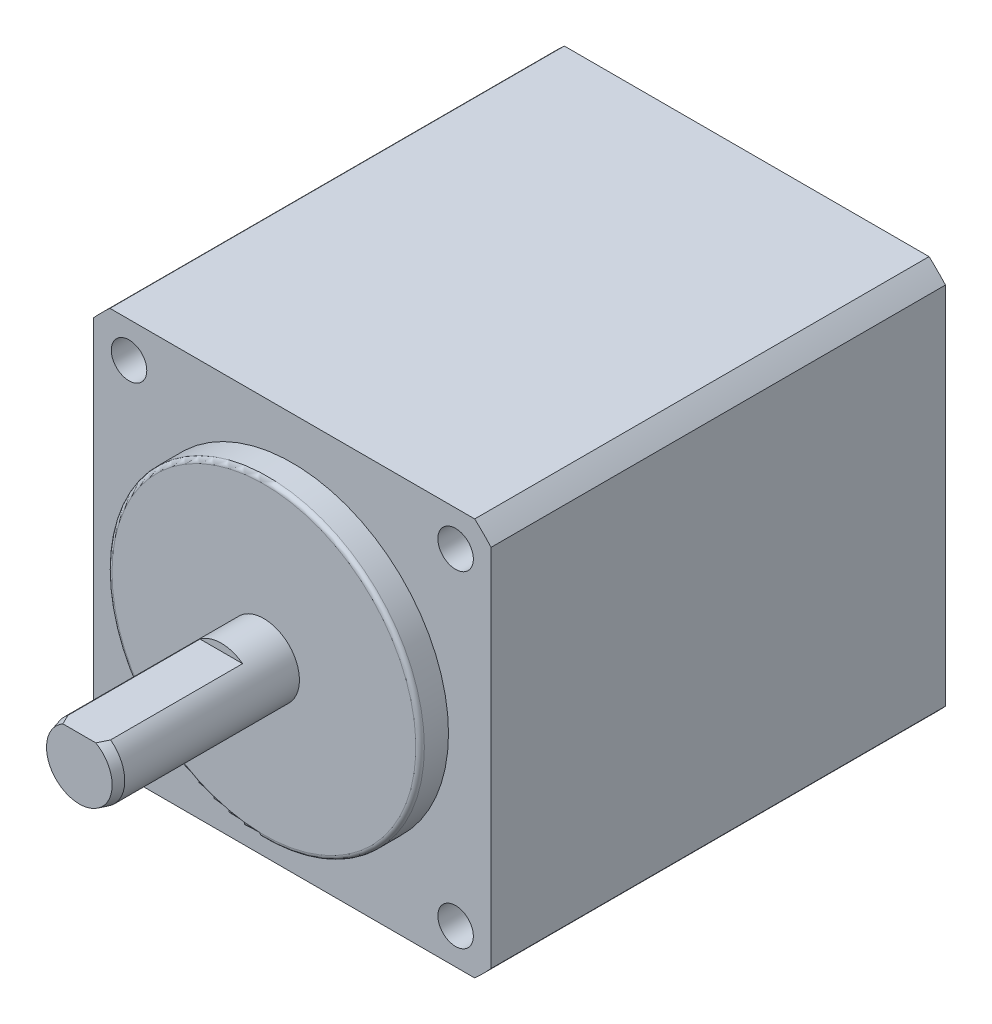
ISO-10303-21;
HEADER;
FILE_DESCRIPTION(('STEP AP214'),'2;1');
FILE_NAME('part.step','',(''),(''),'','','');
FILE_SCHEMA(('AUTOMOTIVE_DESIGN { 1 0 10303 214 1 1 1 1 }'));
ENDSEC;
DATA;
#1=APPLICATION_CONTEXT('core data for automotive mechanical design processes');
#2=APPLICATION_PROTOCOL_DEFINITION('international standard','automotive_design',2000,#1);
#3=PRODUCT_CONTEXT('',#1,'mechanical');
#4=PRODUCT('Part','Part','',(#3));
#5=PRODUCT_RELATED_PRODUCT_CATEGORY('part','',(#4));
#6=PRODUCT_DEFINITION_FORMATION('','',#4);
#7=PRODUCT_DEFINITION_CONTEXT('part definition',#1,'design');
#8=PRODUCT_DEFINITION('design','',#6,#7);
#9=PRODUCT_DEFINITION_SHAPE('','',#8);
#10=(LENGTH_UNIT() NAMED_UNIT(*) SI_UNIT(.MILLI.,.METRE.));
#11=(NAMED_UNIT(*) PLANE_ANGLE_UNIT() SI_UNIT($,.RADIAN.));
#12=(NAMED_UNIT(*) SI_UNIT($,.STERADIAN.) SOLID_ANGLE_UNIT());
#13=UNCERTAINTY_MEASURE_WITH_UNIT(LENGTH_MEASURE(1.E-05),#10,'distance_accuracy_value','');
#14=(GEOMETRIC_REPRESENTATION_CONTEXT(3) GLOBAL_UNCERTAINTY_ASSIGNED_CONTEXT((#13)) GLOBAL_UNIT_ASSIGNED_CONTEXT((#10,
#11,#12)) REPRESENTATION_CONTEXT('',''));
#15=CARTESIAN_POINT('',(0.,0.,0.));
#16=DIRECTION('',(0.,0.,1.));
#17=DIRECTION('',(1.,0.,0.));
#18=AXIS2_PLACEMENT_3D('',#15,#16,#17);
#19=CARTESIAN_POINT('',(-14.,0.,-32.));
#20=DIRECTION('',(1.,0.,0.));
#21=DIRECTION('',(0.,0.,-1.));
#22=AXIS2_PLACEMENT_3D('',#19,#20,#21);
#23=PLANE('',#22);
#24=DIRECTION('',(0.,1.,0.));
#25=VECTOR('',#24,1.);
#26=CARTESIAN_POINT('',(-14.,0.,0.));
#27=LINE('',#26,#25);
#28=CARTESIAN_POINT('',(-14.,-12.8452325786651,0.));
#29=VERTEX_POINT('',#28);
#30=CARTESIAN_POINT('',(-14.,12.8452325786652,0.));
#31=VERTEX_POINT('',#30);
#32=EDGE_CURVE('E315',#29,#31,#27,.T.);
#33=ORIENTED_EDGE('',*,*,#32,.T.);
#34=DIRECTION('',(0.,0.,1.));
#35=VECTOR('',#34,1.);
#36=CARTESIAN_POINT('',(-14.,12.8452325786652,-32.));
#37=LINE('',#36,#35);
#38=CARTESIAN_POINT('',(-14.,12.8452325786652,-32.));
#39=VERTEX_POINT('',#38);
#40=EDGE_CURVE('E219',#39,#31,#37,.T.);
#41=ORIENTED_EDGE('',*,*,#40,.F.);
#42=DIRECTION('',(0.,1.,0.));
#43=VECTOR('',#42,1.);
#44=CARTESIAN_POINT('',(-14.,0.,-32.));
#45=LINE('',#44,#43);
#46=CARTESIAN_POINT('',(-14.,-12.8452325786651,-32.));
#47=VERTEX_POINT('',#46);
#48=EDGE_CURVE('E382',#47,#39,#45,.T.);
#49=ORIENTED_EDGE('',*,*,#48,.F.);
#50=DIRECTION('',(0.,0.,1.));
#51=VECTOR('',#50,1.);
#52=CARTESIAN_POINT('',(-14.,-12.8452325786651,-32.));
#53=LINE('',#52,#51);
#54=EDGE_CURVE('E319',#47,#29,#53,.T.);
#55=ORIENTED_EDGE('',*,*,#54,.T.);
#56=EDGE_LOOP('',(#33,#41,#49,#55));
#57=FACE_BOUND('',#56,.T.);
#58=ADVANCED_FACE('F47',(#57),#23,.F.);
#59=CARTESIAN_POINT('',(0.,0.,-32.));
#60=DIRECTION('',(0.,0.,1.));
#61=DIRECTION('',(1.,0.,0.));
#62=AXIS2_PLACEMENT_3D('',#59,#60,#61);
#63=CYLINDRICAL_SURFACE('',#62,19.);
#64=CARTESIAN_POINT('',(0.,0.,0.));
#65=DIRECTION('',(0.,0.,-1.));
#66=DIRECTION('',(-1.,0.,0.));
#67=AXIS2_PLACEMENT_3D('',#64,#65,#66);
#68=CIRCLE('',#67,19.);
#69=CARTESIAN_POINT('',(-12.8452325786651,14.,0.));
#70=VERTEX_POINT('',#69);
#71=EDGE_CURVE('E322',#31,#70,#68,.T.);
#72=ORIENTED_EDGE('',*,*,#71,.T.);
#73=DIRECTION('',(0.,0.,1.));
#74=VECTOR('',#73,1.);
#75=CARTESIAN_POINT('',(-12.8452325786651,14.,-32.));
#76=LINE('',#75,#74);
#77=CARTESIAN_POINT('',(-12.8452325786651,14.,-32.));
#78=VERTEX_POINT('',#77);
#79=EDGE_CURVE('E356',#78,#70,#76,.T.);
#80=ORIENTED_EDGE('',*,*,#79,.F.);
#81=CARTESIAN_POINT('',(0.,0.,-32.));
#82=DIRECTION('',(0.,0.,-1.));
#83=DIRECTION('',(-1.,0.,0.));
#84=AXIS2_PLACEMENT_3D('',#81,#82,#83);
#85=CIRCLE('',#84,19.);
#86=EDGE_CURVE('E385',#39,#78,#85,.T.);
#87=ORIENTED_EDGE('',*,*,#86,.F.);
#88=ORIENTED_EDGE('',*,*,#40,.T.);
#89=EDGE_LOOP('',(#72,#80,#87,#88));
#90=FACE_BOUND('',#89,.T.);
#91=ADVANCED_FACE('F292',(#90),#63,.T.);
#92=CARTESIAN_POINT('',(0.,14.,-32.));
#93=DIRECTION('',(0.,-1.,0.));
#94=DIRECTION('',(0.,0.,-1.));
#95=AXIS2_PLACEMENT_3D('',#92,#93,#94);
#96=PLANE('',#95);
#97=DIRECTION('',(1.,0.,0.));
#98=VECTOR('',#97,1.);
#99=CARTESIAN_POINT('',(0.,14.,0.));
#100=LINE('',#99,#98);
#101=CARTESIAN_POINT('',(12.8452325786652,14.,0.));
#102=VERTEX_POINT('',#101);
#103=EDGE_CURVE('E325',#70,#102,#100,.T.);
#104=ORIENTED_EDGE('',*,*,#103,.T.);
#105=DIRECTION('',(0.,0.,1.));
#106=VECTOR('',#105,1.);
#107=CARTESIAN_POINT('',(12.8452325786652,14.,-32.));
#108=LINE('',#107,#106);
#109=CARTESIAN_POINT('',(12.8452325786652,14.,-32.));
#110=VERTEX_POINT('',#109);
#111=EDGE_CURVE('E353',#110,#102,#108,.T.);
#112=ORIENTED_EDGE('',*,*,#111,.F.);
#113=DIRECTION('',(1.,0.,0.));
#114=VECTOR('',#113,1.);
#115=CARTESIAN_POINT('',(0.,14.,-32.));
#116=LINE('',#115,#114);
#117=EDGE_CURVE('E387',#78,#110,#116,.T.);
#118=ORIENTED_EDGE('',*,*,#117,.F.);
#119=ORIENTED_EDGE('',*,*,#79,.T.);
#120=EDGE_LOOP('',(#104,#112,#118,#119));
#121=FACE_BOUND('',#120,.T.);
#122=ADVANCED_FACE('F302',(#121),#96,.F.);
#123=CARTESIAN_POINT('',(14.,12.8452325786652,0.));
#124=VERTEX_POINT('',#123);
#125=EDGE_CURVE('E328',#102,#124,#68,.T.);
#126=ORIENTED_EDGE('',*,*,#125,.T.);
#127=DIRECTION('',(0.,0.,1.));
#128=VECTOR('',#127,1.);
#129=CARTESIAN_POINT('',(14.,12.8452325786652,-32.));
#130=LINE('',#129,#128);
#131=CARTESIAN_POINT('',(14.,12.8452325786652,-32.));
#132=VERTEX_POINT('',#131);
#133=EDGE_CURVE('E351',#132,#124,#130,.T.);
#134=ORIENTED_EDGE('',*,*,#133,.F.);
#135=EDGE_CURVE('E388',#110,#132,#85,.T.);
#136=ORIENTED_EDGE('',*,*,#135,.F.);
#137=ORIENTED_EDGE('',*,*,#111,.T.);
#138=EDGE_LOOP('',(#126,#134,#136,#137));
#139=FACE_BOUND('',#138,.T.);
#140=ADVANCED_FACE('F300',(#139),#63,.T.);
#141=CARTESIAN_POINT('',(14.,0.,-32.));
#142=DIRECTION('',(1.,0.,0.));
#143=DIRECTION('',(0.,0.,-1.));
#144=AXIS2_PLACEMENT_3D('',#141,#142,#143);
#145=PLANE('',#144);
#146=DIRECTION('',(0.,1.,0.));
#147=VECTOR('',#146,1.);
#148=CARTESIAN_POINT('',(14.,0.,0.));
#149=LINE('',#148,#147);
#150=CARTESIAN_POINT('',(14.,-12.8452325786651,0.));
#151=VERTEX_POINT('',#150);
#152=EDGE_CURVE('E336',#151,#124,#149,.T.);
#153=ORIENTED_EDGE('',*,*,#152,.F.);
#154=DIRECTION('',(0.,0.,1.));
#155=VECTOR('',#154,1.);
#156=CARTESIAN_POINT('',(14.,-12.8452325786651,-32.));
#157=LINE('',#156,#155);
#158=CARTESIAN_POINT('',(14.,-12.8452325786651,-32.));
#159=VERTEX_POINT('',#158);
#160=EDGE_CURVE('E349',#159,#151,#157,.T.);
#161=ORIENTED_EDGE('',*,*,#160,.F.);
#162=DIRECTION('',(0.,1.,0.));
#163=VECTOR('',#162,1.);
#164=CARTESIAN_POINT('',(14.,0.,-32.));
#165=LINE('',#164,#163);
#166=EDGE_CURVE('E389',#159,#132,#165,.T.);
#167=ORIENTED_EDGE('',*,*,#166,.T.);
#168=ORIENTED_EDGE('',*,*,#133,.T.);
#169=EDGE_LOOP('',(#153,#161,#167,#168));
#170=FACE_BOUND('',#169,.T.);
#171=ADVANCED_FACE('F297',(#170),#145,.T.);
#172=CARTESIAN_POINT('',(12.8452325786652,-14.,0.));
#173=VERTEX_POINT('',#172);
#174=EDGE_CURVE('E339',#151,#173,#68,.T.);
#175=ORIENTED_EDGE('',*,*,#174,.T.);
#176=DIRECTION('',(0.,0.,1.));
#177=VECTOR('',#176,1.);
#178=CARTESIAN_POINT('',(12.8452325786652,-14.,-32.));
#179=LINE('',#178,#177);
#180=CARTESIAN_POINT('',(12.8452325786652,-14.,-32.));
#181=VERTEX_POINT('',#180);
#182=EDGE_CURVE('E347',#181,#173,#179,.T.);
#183=ORIENTED_EDGE('',*,*,#182,.F.);
#184=EDGE_CURVE('E364',#159,#181,#85,.T.);
#185=ORIENTED_EDGE('',*,*,#184,.F.);
#186=ORIENTED_EDGE('',*,*,#160,.T.);
#187=EDGE_LOOP('',(#175,#183,#185,#186));
#188=FACE_BOUND('',#187,.T.);
#189=ADVANCED_FACE('F293',(#188),#63,.T.);
#190=CARTESIAN_POINT('',(0.,-14.,-32.));
#191=DIRECTION('',(0.,-1.,0.));
#192=DIRECTION('',(0.,0.,-1.));
#193=AXIS2_PLACEMENT_3D('',#190,#191,#192);
#194=PLANE('',#193);
#195=DIRECTION('',(0.,0.,-1.));
#196=VECTOR('',#195,1.);
#197=CARTESIAN_POINT('',(-7.6,-14.,-32.));
#198=LINE('',#197,#196);
#199=CARTESIAN_POINT('',(-7.6,-14.,-22.5));
#200=VERTEX_POINT('',#199);
#201=CARTESIAN_POINT('',(-7.6,-14.,-32.));
#202=VERTEX_POINT('',#201);
#203=EDGE_CURVE('E191',#200,#202,#198,.T.);
#204=ORIENTED_EDGE('',*,*,#203,.F.);
#205=DIRECTION('',(-1.,0.,0.));
#206=VECTOR('',#205,1.);
#207=CARTESIAN_POINT('',(-7.6,-14.,-22.5));
#208=LINE('',#207,#206);
#209=CARTESIAN_POINT('',(7.6,-14.,-22.5));
#210=VERTEX_POINT('',#209);
#211=EDGE_CURVE('E198',#210,#200,#208,.T.);
#212=ORIENTED_EDGE('',*,*,#211,.F.);
#213=DIRECTION('',(0.,0.,1.));
#214=VECTOR('',#213,1.);
#215=CARTESIAN_POINT('',(7.6,-14.,-32.));
#216=LINE('',#215,#214);
#217=CARTESIAN_POINT('',(7.6,-14.,-32.));
#218=VERTEX_POINT('',#217);
#219=EDGE_CURVE('E212',#218,#210,#216,.T.);
#220=ORIENTED_EDGE('',*,*,#219,.F.);
#221=DIRECTION('',(1.,0.,0.));
#222=VECTOR('',#221,1.);
#223=CARTESIAN_POINT('',(0.,-14.,-32.));
#224=LINE('',#223,#222);
#225=EDGE_CURVE('E362',#218,#181,#224,.T.);
#226=ORIENTED_EDGE('',*,*,#225,.T.);
#227=ORIENTED_EDGE('',*,*,#182,.T.);
#228=DIRECTION('',(1.,0.,0.));
#229=VECTOR('',#228,1.);
#230=CARTESIAN_POINT('',(0.,-14.,0.));
#231=LINE('',#230,#229);
#232=CARTESIAN_POINT('',(-12.8452325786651,-14.,0.));
#233=VERTEX_POINT('',#232);
#234=EDGE_CURVE('E340',#233,#173,#231,.T.);
#235=ORIENTED_EDGE('',*,*,#234,.F.);
#236=DIRECTION('',(0.,0.,1.));
#237=VECTOR('',#236,1.);
#238=CARTESIAN_POINT('',(-12.8452325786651,-14.,-32.));
#239=LINE('',#238,#237);
#240=CARTESIAN_POINT('',(-12.8452325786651,-14.,-32.));
#241=VERTEX_POINT('',#240);
#242=EDGE_CURVE('E344',#241,#233,#239,.T.);
#243=ORIENTED_EDGE('',*,*,#242,.F.);
#244=EDGE_CURVE('E360',#241,#202,#224,.T.);
#245=ORIENTED_EDGE('',*,*,#244,.T.);
#246=EDGE_LOOP('',(#204,#212,#220,#226,#227,#235,#243,#245));
#247=FACE_BOUND('',#246,.T.);
#248=ADVANCED_FACE('F290',(#247),#194,.T.);
#249=EDGE_CURVE('E327',#233,#29,#68,.T.);
#250=ORIENTED_EDGE('',*,*,#249,.T.);
#251=ORIENTED_EDGE('',*,*,#54,.F.);
#252=EDGE_CURVE('E345',#241,#47,#85,.T.);
#253=ORIENTED_EDGE('',*,*,#252,.F.);
#254=ORIENTED_EDGE('',*,*,#242,.T.);
#255=EDGE_LOOP('',(#250,#251,#253,#254));
#256=FACE_BOUND('',#255,.T.);
#257=ADVANCED_FACE('F284',(#256),#63,.T.);
#258=CARTESIAN_POINT('',(0.,0.,-32.));
#259=DIRECTION('',(0.,0.,-1.));
#260=DIRECTION('',(-1.,0.,0.));
#261=AXIS2_PLACEMENT_3D('',#258,#259,#260);
#262=PLANE('',#261);
#263=DIRECTION('',(-1.,0.,0.));
#264=VECTOR('',#263,1.);
#265=CARTESIAN_POINT('',(0.,2.,-32.));
#266=LINE('',#265,#264);
#267=CARTESIAN_POINT('',(1.5,2.,-32.));
#268=VERTEX_POINT('',#267);
#269=CARTESIAN_POINT('',(-1.5,2.,-32.));
#270=VERTEX_POINT('',#269);
#271=EDGE_CURVE('E154',#268,#270,#266,.T.);
#272=ORIENTED_EDGE('',*,*,#271,.T.);
#273=CARTESIAN_POINT('',(0.,0.,-32.));
#274=DIRECTION('',(0.,0.,-1.));
#275=DIRECTION('',(-1.,0.,0.));
#276=AXIS2_PLACEMENT_3D('',#273,#274,#275);
#277=CIRCLE('',#276,2.5);
#278=EDGE_CURVE('E159',#268,#270,#277,.T.);
#279=ORIENTED_EDGE('',*,*,#278,.F.);
#280=EDGE_LOOP('',(#272,#279));
#281=FACE_BOUND('',#280,.T.);
#282=ORIENTED_EDGE('',*,*,#48,.T.);
#283=ORIENTED_EDGE('',*,*,#86,.T.);
#284=ORIENTED_EDGE('',*,*,#117,.T.);
#285=ORIENTED_EDGE('',*,*,#135,.T.);
#286=ORIENTED_EDGE('',*,*,#166,.F.);
#287=ORIENTED_EDGE('',*,*,#184,.T.);
#288=ORIENTED_EDGE('',*,*,#225,.F.);
#289=DIRECTION('',(0.,1.,0.));
#290=VECTOR('',#289,1.);
#291=CARTESIAN_POINT('',(7.6,-19.,-32.));
#292=LINE('',#291,#290);
#293=CARTESIAN_POINT('',(7.6,-19.,-32.));
#294=VERTEX_POINT('',#293);
#295=EDGE_CURVE('E330',#294,#218,#292,.T.);
#296=ORIENTED_EDGE('',*,*,#295,.F.);
#297=DIRECTION('',(1.,0.,0.));
#298=VECTOR('',#297,1.);
#299=CARTESIAN_POINT('',(-7.6,-19.,-32.));
#300=LINE('',#299,#298);
#301=CARTESIAN_POINT('',(-7.6,-19.,-32.));
#302=VERTEX_POINT('',#301);
#303=EDGE_CURVE('E197',#302,#294,#300,.T.);
#304=ORIENTED_EDGE('',*,*,#303,.F.);
#305=DIRECTION('',(0.,1.,0.));
#306=VECTOR('',#305,1.);
#307=CARTESIAN_POINT('',(-7.6,-19.,-32.));
#308=LINE('',#307,#306);
#309=EDGE_CURVE('E323',#302,#202,#308,.T.);
#310=ORIENTED_EDGE('',*,*,#309,.T.);
#311=ORIENTED_EDGE('',*,*,#244,.F.);
#312=ORIENTED_EDGE('',*,*,#252,.T.);
#313=EDGE_LOOP('',(#282,#283,#284,#285,#286,#287,#288,#296,#304,#310,#311,#312));
#314=FACE_BOUND('',#313,.T.);
#315=ADVANCED_FACE('F163',(#281,#314),#262,.T.);
#316=CARTESIAN_POINT('',(0.,0.,0.));
#317=DIRECTION('',(0.,0.,-1.));
#318=DIRECTION('',(-1.,0.,0.));
#319=AXIS2_PLACEMENT_3D('',#316,#317,#318);
#320=PLANE('',#319);
#321=CARTESIAN_POINT('',(11.5,-11.5,0.));
#322=DIRECTION('',(0.,0.,1.));
#323=DIRECTION('',(1.,0.,0.));
#324=AXIS2_PLACEMENT_3D('',#321,#322,#323);
#325=CIRCLE('',#324,1.25);
#326=CARTESIAN_POINT('',(12.75,-11.5,0.));
#327=VERTEX_POINT('',#326);
#328=EDGE_CURVE('E169',#327,#327,#325,.T.);
#329=ORIENTED_EDGE('',*,*,#328,.F.);
#330=EDGE_LOOP('',(#329));
#331=FACE_BOUND('',#330,.T.);
#332=CARTESIAN_POINT('',(-11.5,-11.5,0.));
#333=DIRECTION('',(0.,0.,1.));
#334=DIRECTION('',(1.,0.,0.));
#335=AXIS2_PLACEMENT_3D('',#332,#333,#334);
#336=CIRCLE('',#335,1.25);
#337=CARTESIAN_POINT('',(-10.25,-11.5,0.));
#338=VERTEX_POINT('',#337);
#339=EDGE_CURVE('E173',#338,#338,#336,.T.);
#340=ORIENTED_EDGE('',*,*,#339,.F.);
#341=EDGE_LOOP('',(#340));
#342=FACE_BOUND('',#341,.T.);
#343=CARTESIAN_POINT('',(11.5,11.5,0.));
#344=DIRECTION('',(0.,0.,1.));
#345=DIRECTION('',(1.,0.,0.));
#346=AXIS2_PLACEMENT_3D('',#343,#344,#345);
#347=CIRCLE('',#346,1.25);
#348=CARTESIAN_POINT('',(12.75,11.5,0.));
#349=VERTEX_POINT('',#348);
#350=EDGE_CURVE('E179',#349,#349,#347,.T.);
#351=ORIENTED_EDGE('',*,*,#350,.F.);
#352=EDGE_LOOP('',(#351));
#353=FACE_BOUND('',#352,.T.);
#354=CARTESIAN_POINT('',(-11.5,11.5,0.));
#355=DIRECTION('',(0.,0.,1.));
#356=DIRECTION('',(1.,0.,0.));
#357=AXIS2_PLACEMENT_3D('',#354,#355,#356);
#358=CIRCLE('',#357,1.25);
#359=CARTESIAN_POINT('',(-10.25,11.5,0.));
#360=VERTEX_POINT('',#359);
#361=EDGE_CURVE('E185',#360,#360,#358,.T.);
#362=ORIENTED_EDGE('',*,*,#361,.F.);
#363=EDGE_LOOP('',(#362));
#364=FACE_BOUND('',#363,.T.);
#365=ORIENTED_EDGE('',*,*,#32,.F.);
#366=ORIENTED_EDGE('',*,*,#249,.F.);
#367=ORIENTED_EDGE('',*,*,#234,.T.);
#368=ORIENTED_EDGE('',*,*,#174,.F.);
#369=ORIENTED_EDGE('',*,*,#152,.T.);
#370=ORIENTED_EDGE('',*,*,#125,.F.);
#371=ORIENTED_EDGE('',*,*,#103,.F.);
#372=ORIENTED_EDGE('',*,*,#71,.F.);
#373=EDGE_LOOP('',(#365,#366,#367,#368,#369,#370,#371,#372));
#374=FACE_BOUND('',#373,.T.);
#375=ADVANCED_FACE('F280',(#331,#342,#353,#364,#374),#320,.F.);
#376=CARTESIAN_POINT('',(-7.6,-19.,-32.));
#377=DIRECTION('',(1.,0.,0.));
#378=DIRECTION('',(0.,0.,-1.));
#379=AXIS2_PLACEMENT_3D('',#376,#377,#378);
#380=PLANE('',#379);
#381=ORIENTED_EDGE('',*,*,#203,.T.);
#382=ORIENTED_EDGE('',*,*,#309,.F.);
#383=DIRECTION('',(0.,0.,-1.));
#384=VECTOR('',#383,1.);
#385=CARTESIAN_POINT('',(-7.6,-19.,-32.));
#386=LINE('',#385,#384);
#387=CARTESIAN_POINT('',(-7.6,-19.,-22.5));
#388=VERTEX_POINT('',#387);
#389=EDGE_CURVE('E194',#388,#302,#386,.T.);
#390=ORIENTED_EDGE('',*,*,#389,.F.);
#391=DIRECTION('',(0.,1.,0.));
#392=VECTOR('',#391,1.);
#393=CARTESIAN_POINT('',(-7.6,-19.,-22.5));
#394=LINE('',#393,#392);
#395=EDGE_CURVE('E204',#388,#200,#394,.T.);
#396=ORIENTED_EDGE('',*,*,#395,.T.);
#397=EDGE_LOOP('',(#381,#382,#390,#396));
#398=FACE_BOUND('',#397,.T.);
#399=ADVANCED_FACE('F276',(#398),#380,.F.);
#400=CARTESIAN_POINT('',(7.6,-19.,-32.));
#401=DIRECTION('',(-1.,0.,0.));
#402=DIRECTION('',(0.,0.,1.));
#403=AXIS2_PLACEMENT_3D('',#400,#401,#402);
#404=PLANE('',#403);
#405=ORIENTED_EDGE('',*,*,#219,.T.);
#406=DIRECTION('',(0.,1.,0.));
#407=VECTOR('',#406,1.);
#408=CARTESIAN_POINT('',(7.6,-19.,-22.5));
#409=LINE('',#408,#407);
#410=CARTESIAN_POINT('',(7.6,-19.,-22.5));
#411=VERTEX_POINT('',#410);
#412=EDGE_CURVE('E371',#411,#210,#409,.T.);
#413=ORIENTED_EDGE('',*,*,#412,.F.);
#414=DIRECTION('',(0.,0.,1.));
#415=VECTOR('',#414,1.);
#416=CARTESIAN_POINT('',(7.6,-19.,-32.));
#417=LINE('',#416,#415);
#418=EDGE_CURVE('E200',#294,#411,#417,.T.);
#419=ORIENTED_EDGE('',*,*,#418,.F.);
#420=ORIENTED_EDGE('',*,*,#295,.T.);
#421=EDGE_LOOP('',(#405,#413,#419,#420));
#422=FACE_BOUND('',#421,.T.);
#423=ADVANCED_FACE('F272',(#422),#404,.F.);
#424=CARTESIAN_POINT('',(-7.6,-19.,-22.5));
#425=DIRECTION('',(0.,0.,-1.));
#426=DIRECTION('',(-1.,0.,0.));
#427=AXIS2_PLACEMENT_3D('',#424,#425,#426);
#428=PLANE('',#427);
#429=ORIENTED_EDGE('',*,*,#211,.T.);
#430=ORIENTED_EDGE('',*,*,#395,.F.);
#431=DIRECTION('',(-1.,0.,0.));
#432=VECTOR('',#431,1.);
#433=CARTESIAN_POINT('',(-7.6,-19.,-22.5));
#434=LINE('',#433,#432);
#435=EDGE_CURVE('E202',#411,#388,#434,.T.);
#436=ORIENTED_EDGE('',*,*,#435,.F.);
#437=ORIENTED_EDGE('',*,*,#412,.T.);
#438=EDGE_LOOP('',(#429,#430,#436,#437));
#439=FACE_BOUND('',#438,.T.);
#440=ADVANCED_FACE('F268',(#439),#428,.F.);
#441=CARTESIAN_POINT('',(0.,-19.,0.));
#442=DIRECTION('',(0.,1.,0.));
#443=DIRECTION('',(0.,0.,1.));
#444=AXIS2_PLACEMENT_3D('',#441,#442,#443);
#445=PLANE('',#444);
#446=ORIENTED_EDGE('',*,*,#389,.T.);
#447=ORIENTED_EDGE('',*,*,#303,.T.);
#448=ORIENTED_EDGE('',*,*,#418,.T.);
#449=ORIENTED_EDGE('',*,*,#435,.T.);
#450=EDGE_LOOP('',(#446,#447,#448,#449));
#451=FACE_BOUND('',#450,.T.);
#452=ADVANCED_FACE('F264',(#451),#445,.F.);
#453=CARTESIAN_POINT('',(-11.5,11.5,-4.5));
#454=DIRECTION('',(0.,0.,1.));
#455=DIRECTION('',(1.,0.,0.));
#456=AXIS2_PLACEMENT_3D('',#453,#454,#455);
#457=CYLINDRICAL_SURFACE('',#456,1.25);
#458=CARTESIAN_POINT('',(-11.5,11.5,-4.5));
#459=DIRECTION('',(0.,0.,1.));
#460=DIRECTION('',(1.,0.,0.));
#461=AXIS2_PLACEMENT_3D('',#458,#459,#460);
#462=CIRCLE('',#461,1.25);
#463=CARTESIAN_POINT('',(-10.25,11.5,-4.5));
#464=VERTEX_POINT('',#463);
#465=EDGE_CURVE('E188',#464,#464,#462,.T.);
#466=ORIENTED_EDGE('',*,*,#465,.F.);
#467=EDGE_LOOP('',(#466));
#468=FACE_BOUND('',#467,.T.);
#469=ORIENTED_EDGE('',*,*,#361,.T.);
#470=EDGE_LOOP('',(#469));
#471=FACE_BOUND('',#470,.T.);
#472=ADVANCED_FACE('F260',(#468,#471),#457,.F.);
#473=CARTESIAN_POINT('',(-11.5,11.5,-4.5));
#474=DIRECTION('',(0.,0.,1.));
#475=DIRECTION('',(1.,0.,0.));
#476=AXIS2_PLACEMENT_3D('',#473,#474,#475);
#477=PLANE('',#476);
#478=ORIENTED_EDGE('',*,*,#465,.T.);
#479=EDGE_LOOP('',(#478));
#480=FACE_BOUND('',#479,.T.);
#481=ADVANCED_FACE('F256',(#480),#477,.T.);
#482=CARTESIAN_POINT('',(11.5,11.5,-4.5));
#483=DIRECTION('',(0.,0.,1.));
#484=DIRECTION('',(1.,0.,0.));
#485=AXIS2_PLACEMENT_3D('',#482,#483,#484);
#486=CYLINDRICAL_SURFACE('',#485,1.25);
#487=CARTESIAN_POINT('',(11.5,11.5,-4.5));
#488=DIRECTION('',(0.,0.,1.));
#489=DIRECTION('',(1.,0.,0.));
#490=AXIS2_PLACEMENT_3D('',#487,#488,#489);
#491=CIRCLE('',#490,1.25);
#492=CARTESIAN_POINT('',(12.75,11.5,-4.5));
#493=VERTEX_POINT('',#492);
#494=EDGE_CURVE('E182',#493,#493,#491,.T.);
#495=ORIENTED_EDGE('',*,*,#494,.F.);
#496=EDGE_LOOP('',(#495));
#497=FACE_BOUND('',#496,.T.);
#498=ORIENTED_EDGE('',*,*,#350,.T.);
#499=EDGE_LOOP('',(#498));
#500=FACE_BOUND('',#499,.T.);
#501=ADVANCED_FACE('F252',(#497,#500),#486,.F.);
#502=CARTESIAN_POINT('',(11.5,11.5,-4.5));
#503=DIRECTION('',(0.,0.,1.));
#504=DIRECTION('',(1.,0.,0.));
#505=AXIS2_PLACEMENT_3D('',#502,#503,#504);
#506=PLANE('',#505);
#507=ORIENTED_EDGE('',*,*,#494,.T.);
#508=EDGE_LOOP('',(#507));
#509=FACE_BOUND('',#508,.T.);
#510=ADVANCED_FACE('F248',(#509),#506,.T.);
#511=CARTESIAN_POINT('',(-11.5,-11.5,-4.5));
#512=DIRECTION('',(0.,0.,1.));
#513=DIRECTION('',(1.,0.,0.));
#514=AXIS2_PLACEMENT_3D('',#511,#512,#513);
#515=CYLINDRICAL_SURFACE('',#514,1.25);
#516=CARTESIAN_POINT('',(-11.5,-11.5,-4.5));
#517=DIRECTION('',(0.,0.,1.));
#518=DIRECTION('',(1.,0.,0.));
#519=AXIS2_PLACEMENT_3D('',#516,#517,#518);
#520=CIRCLE('',#519,1.25);
#521=CARTESIAN_POINT('',(-10.25,-11.5,-4.5));
#522=VERTEX_POINT('',#521);
#523=EDGE_CURVE('E176',#522,#522,#520,.T.);
#524=ORIENTED_EDGE('',*,*,#523,.F.);
#525=EDGE_LOOP('',(#524));
#526=FACE_BOUND('',#525,.T.);
#527=ORIENTED_EDGE('',*,*,#339,.T.);
#528=EDGE_LOOP('',(#527));
#529=FACE_BOUND('',#528,.T.);
#530=ADVANCED_FACE('F244',(#526,#529),#515,.F.);
#531=CARTESIAN_POINT('',(-11.5,-11.5,-4.5));
#532=DIRECTION('',(0.,0.,1.));
#533=DIRECTION('',(1.,0.,0.));
#534=AXIS2_PLACEMENT_3D('',#531,#532,#533);
#535=PLANE('',#534);
#536=ORIENTED_EDGE('',*,*,#523,.T.);
#537=EDGE_LOOP('',(#536));
#538=FACE_BOUND('',#537,.T.);
#539=ADVANCED_FACE('F240',(#538),#535,.T.);
#540=CARTESIAN_POINT('',(11.5,-11.5,-4.5));
#541=DIRECTION('',(0.,0.,1.));
#542=DIRECTION('',(1.,0.,0.));
#543=AXIS2_PLACEMENT_3D('',#540,#541,#542);
#544=CYLINDRICAL_SURFACE('',#543,1.25);
#545=CARTESIAN_POINT('',(11.5,-11.5,-4.5));
#546=DIRECTION('',(0.,0.,1.));
#547=DIRECTION('',(1.,0.,0.));
#548=AXIS2_PLACEMENT_3D('',#545,#546,#547);
#549=CIRCLE('',#548,1.25);
#550=CARTESIAN_POINT('',(12.75,-11.5,-4.5));
#551=VERTEX_POINT('',#550);
#552=EDGE_CURVE('E170',#551,#551,#549,.T.);
#553=ORIENTED_EDGE('',*,*,#552,.F.);
#554=EDGE_LOOP('',(#553));
#555=FACE_BOUND('',#554,.T.);
#556=ORIENTED_EDGE('',*,*,#328,.T.);
#557=EDGE_LOOP('',(#556));
#558=FACE_BOUND('',#557,.T.);
#559=ADVANCED_FACE('F236',(#555,#558),#544,.F.);
#560=CARTESIAN_POINT('',(11.5,-11.5,-4.5));
#561=DIRECTION('',(0.,0.,1.));
#562=DIRECTION('',(1.,0.,0.));
#563=AXIS2_PLACEMENT_3D('',#560,#561,#562);
#564=PLANE('',#563);
#565=ORIENTED_EDGE('',*,*,#552,.T.);
#566=EDGE_LOOP('',(#565));
#567=FACE_BOUND('',#566,.T.);
#568=ADVANCED_FACE('F231',(#567),#564,.T.);
#569=CARTESIAN_POINT('',(0.,2.,-42.));
#570=DIRECTION('',(0.,1.,0.));
#571=DIRECTION('',(0.,0.,1.));
#572=AXIS2_PLACEMENT_3D('',#569,#570,#571);
#573=PLANE('',#572);
#574=DIRECTION('',(-1.,0.,0.));
#575=VECTOR('',#574,1.);
#576=CARTESIAN_POINT('',(0.,2.,-42.));
#577=LINE('',#576,#575);
#578=CARTESIAN_POINT('',(1.16075761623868,2.,-42.));
#579=VERTEX_POINT('',#578);
#580=CARTESIAN_POINT('',(-1.16075761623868,2.,-42.));
#581=VERTEX_POINT('',#580);
#582=EDGE_CURVE('E157',#579,#581,#577,.T.);
#583=ORIENTED_EDGE('',*,*,#582,.T.);
#584=CARTESIAN_POINT('',(-1.16075761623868,2.,-42.));
#585=CARTESIAN_POINT('',(-1.19128641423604,2.,-41.9427849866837));
#586=CARTESIAN_POINT('',(-1.22113150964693,2.,-41.8852109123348));
#587=CARTESIAN_POINT('',(-1.27963273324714,2.,-41.7694828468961));
#588=CARTESIAN_POINT('',(-1.30828921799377,2.,-41.711329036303));
#589=CARTESIAN_POINT('',(-1.36460851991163,2.,-41.5945478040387));
#590=CARTESIAN_POINT('',(-1.39227138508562,2.,-41.535920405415));
#591=CARTESIAN_POINT('',(-1.44674461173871,2.,-41.418249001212));
#592=CARTESIAN_POINT('',(-1.47355471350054,2.,-41.3592048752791));
#593=CARTESIAN_POINT('',(-1.5,2.,-41.3));
#594=B_SPLINE_CURVE_WITH_KNOTS('',3,(#584,#585,#586,#587,#588,#589,#590,#591,#592,#593),
.UNSPECIFIED.,.F.,.F.,(4,2,2,2,4),(0.,0.194539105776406,0.389019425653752,0.583490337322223,
0.778019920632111),.UNSPECIFIED.);
#595=CARTESIAN_POINT('',(-1.5,2.,-41.3));
#596=VERTEX_POINT('',#595);
#597=EDGE_CURVE('E56',#581,#596,#594,.T.);
#598=ORIENTED_EDGE('',*,*,#597,.T.);
#599=DIRECTION('',(0.,0.,1.));
#600=VECTOR('',#599,1.);
#601=CARTESIAN_POINT('',(-1.5,2.,-42.));
#602=LINE('',#601,#600);
#603=EDGE_CURVE('E150',#596,#270,#602,.T.);
#604=ORIENTED_EDGE('',*,*,#603,.T.);
#605=ORIENTED_EDGE('',*,*,#271,.F.);
#606=DIRECTION('',(0.,0.,1.));
#607=VECTOR('',#606,1.);
#608=CARTESIAN_POINT('',(1.5,2.,-42.));
#609=LINE('',#608,#607);
#610=CARTESIAN_POINT('',(1.5,2.,-41.3));
#611=VERTEX_POINT('',#610);
#612=EDGE_CURVE('E156',#611,#268,#609,.T.);
#613=ORIENTED_EDGE('',*,*,#612,.F.);
#614=CARTESIAN_POINT('',(1.5,2.,-41.3));
#615=CARTESIAN_POINT('',(1.47355471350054,2.,-41.3592048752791));
#616=CARTESIAN_POINT('',(1.44674461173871,2.,-41.4182490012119));
#617=CARTESIAN_POINT('',(1.39227138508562,2.,-41.535920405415));
#618=CARTESIAN_POINT('',(1.36460851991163,2.,-41.5945478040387));
#619=CARTESIAN_POINT('',(1.30828921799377,2.,-41.711329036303));
#620=CARTESIAN_POINT('',(1.27963273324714,2.,-41.7694828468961));
#621=CARTESIAN_POINT('',(1.22113150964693,2.,-41.8852109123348));
#622=CARTESIAN_POINT('',(1.19128641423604,2.,-41.9427849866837));
#623=CARTESIAN_POINT('',(1.16075761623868,2.,-42.));
#624=B_SPLINE_CURVE_WITH_KNOTS('',3,(#614,#615,#616,#617,#618,#619,#620,#621,#622,#623),
.UNSPECIFIED.,.F.,.F.,(4,2,2,2,4),(0.,0.19452958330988,0.389000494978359,0.583480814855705,
0.778019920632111),.UNSPECIFIED.);
#625=EDGE_CURVE('E218',#611,#579,#624,.T.);
#626=ORIENTED_EDGE('',*,*,#625,.T.);
#627=EDGE_LOOP('',(#583,#598,#604,#605,#613,#626));
#628=FACE_BOUND('',#627,.T.);
#629=ADVANCED_FACE('F152',(#628),#573,.T.);
#630=CARTESIAN_POINT('',(0.,0.,-42.));
#631=DIRECTION('',(0.,0.,1.));
#632=DIRECTION('',(1.,0.,0.));
#633=AXIS2_PLACEMENT_3D('',#630,#631,#632);
#634=CYLINDRICAL_SURFACE('',#633,2.5);
#635=ORIENTED_EDGE('',*,*,#603,.F.);
#636=CARTESIAN_POINT('',(0.,0.,-41.3));
#637=DIRECTION('',(0.,0.,-1.));
#638=DIRECTION('',(-1.,0.,0.));
#639=AXIS2_PLACEMENT_3D('',#636,#637,#638);
#640=CIRCLE('',#639,2.5);
#641=EDGE_CURVE('E12',#596,#611,#640,.F.);
#642=ORIENTED_EDGE('',*,*,#641,.T.);
#643=ORIENTED_EDGE('',*,*,#612,.T.);
#644=ORIENTED_EDGE('',*,*,#278,.T.);
#645=EDGE_LOOP('',(#635,#642,#643,#644));
#646=FACE_BOUND('',#645,.T.);
#647=ADVANCED_FACE('F160',(#646),#634,.T.);
#648=CARTESIAN_POINT('',(0.,0.,-42.));
#649=DIRECTION('',(0.,0.,-1.));
#650=DIRECTION('',(-1.,0.,0.));
#651=AXIS2_PLACEMENT_3D('',#648,#649,#650);
#652=PLANE('',#651);
#653=ORIENTED_EDGE('',*,*,#582,.F.);
#654=CARTESIAN_POINT('',(0.,0.,-42.));
#655=DIRECTION('',(0.,0.,-1.));
#656=DIRECTION('',(-1.,0.,0.));
#657=AXIS2_PLACEMENT_3D('',#654,#655,#656);
#658=CIRCLE('',#657,2.31243556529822);
#659=EDGE_CURVE('E215',#579,#581,#658,.T.);
#660=ORIENTED_EDGE('',*,*,#659,.T.);
#661=EDGE_LOOP('',(#653,#660));
#662=FACE_BOUND('',#661,.T.);
#663=ADVANCED_FACE('F543',(#662),#652,.T.);
#664=CARTESIAN_POINT('',(0.,0.,-42.));
#665=DIRECTION('',(0.,0.,1.));
#666=DIRECTION('',(1.,0.,0.));
#667=AXIS2_PLACEMENT_3D('',#664,#665,#666);
#668=CONICAL_SURFACE('',#667,2.31243556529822,0.261799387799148);
#669=ORIENTED_EDGE('',*,*,#625,.F.);
#670=ORIENTED_EDGE('',*,*,#641,.F.);
#671=ORIENTED_EDGE('',*,*,#597,.F.);
#672=ORIENTED_EDGE('',*,*,#659,.F.);
#673=EDGE_LOOP('',(#669,#670,#671,#672));
#674=FACE_BOUND('',#673,.T.);
#675=ADVANCED_FACE('F49',(#674),#668,.T.);
#676=CLOSED_SHELL('',(#58,#91,#122,#140,#171,#189,#248,#257,#315,#375,#399,#423,#440,#452,#472,
#481,#501,#510,#530,#539,#559,#568,#629,#647,#663,#675));
#677=MANIFOLD_SOLID_BREP('B2',#676);
#678=CARTESIAN_POINT('',(0.,0.,15.));
#679=DIRECTION('',(0.,0.,-1.));
#680=DIRECTION('',(-1.,0.,0.));
#681=AXIS2_PLACEMENT_3D('',#678,#679,#680);
#682=CYLINDRICAL_SURFACE('',#681,2.5);
#683=DIRECTION('',(0.,0.,-1.));
#684=VECTOR('',#683,1.);
#685=CARTESIAN_POINT('',(1.5,2.,15.));
#686=LINE('',#685,#684);
#687=CARTESIAN_POINT('',(1.5,2.,5.));
#688=VERTEX_POINT('',#687);
#689=CARTESIAN_POINT('',(1.5,2.,14.3));
#690=VERTEX_POINT('',#689);
#691=EDGE_CURVE('E643',#688,#690,#686,.F.);
#692=ORIENTED_EDGE('',*,*,#691,.T.);
#693=CARTESIAN_POINT('',(0.,0.,14.3));
#694=DIRECTION('',(0.,0.,1.));
#695=DIRECTION('',(1.,0.,0.));
#696=AXIS2_PLACEMENT_3D('',#693,#694,#695);
#697=CIRCLE('',#696,2.5);
#698=CARTESIAN_POINT('',(-1.5,2.,14.3));
#699=VERTEX_POINT('',#698);
#700=EDGE_CURVE('E618',#690,#699,#697,.F.);
#701=ORIENTED_EDGE('',*,*,#700,.T.);
#702=DIRECTION('',(0.,0.,-1.));
#703=VECTOR('',#702,1.);
#704=CARTESIAN_POINT('',(-1.5,2.,15.));
#705=LINE('',#704,#703);
#706=CARTESIAN_POINT('',(-1.5,2.,5.));
#707=VERTEX_POINT('',#706);
#708=EDGE_CURVE('E636',#699,#707,#705,.T.);
#709=ORIENTED_EDGE('',*,*,#708,.T.);
#710=CARTESIAN_POINT('',(0.,0.,5.));
#711=DIRECTION('',(0.,0.,1.));
#712=DIRECTION('',(1.,0.,0.));
#713=AXIS2_PLACEMENT_3D('',#710,#711,#712);
#714=CIRCLE('',#713,2.5);
#715=EDGE_CURVE('E639',#688,#707,#714,.T.);
#716=ORIENTED_EDGE('',*,*,#715,.F.);
#717=EDGE_LOOP('',(#692,#701,#709,#716));
#718=FACE_BOUND('',#717,.T.);
#719=CARTESIAN_POINT('',(0.,0.,2.));
#720=DIRECTION('',(0.,0.,-1.));
#721=DIRECTION('',(-1.,0.,0.));
#722=AXIS2_PLACEMENT_3D('',#719,#720,#721);
#723=CIRCLE('',#722,2.5);
#724=CARTESIAN_POINT('',(-2.5,0.,2.));
#725=VERTEX_POINT('',#724);
#726=EDGE_CURVE('E658',#725,#725,#723,.T.);
#727=ORIENTED_EDGE('',*,*,#726,.F.);
#728=EDGE_LOOP('',(#727));
#729=FACE_BOUND('',#728,.T.);
#730=ADVANCED_FACE('F603',(#718,#729),#682,.T.);
#731=CARTESIAN_POINT('',(0.,0.,15.));
#732=DIRECTION('',(0.,0.,1.));
#733=DIRECTION('',(1.,0.,0.));
#734=AXIS2_PLACEMENT_3D('',#731,#732,#733);
#735=PLANE('',#734);
#736=DIRECTION('',(1.,0.,0.));
#737=VECTOR('',#736,1.);
#738=CARTESIAN_POINT('',(0.,2.,15.));
#739=LINE('',#738,#737);
#740=CARTESIAN_POINT('',(-1.16075761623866,2.,15.));
#741=VERTEX_POINT('',#740);
#742=CARTESIAN_POINT('',(1.16075761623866,2.,15.));
#743=VERTEX_POINT('',#742);
#744=EDGE_CURVE('E650',#741,#743,#739,.T.);
#745=ORIENTED_EDGE('',*,*,#744,.F.);
#746=CARTESIAN_POINT('',(0.,0.,15.));
#747=DIRECTION('',(0.,0.,1.));
#748=DIRECTION('',(1.,0.,0.));
#749=AXIS2_PLACEMENT_3D('',#746,#747,#748);
#750=CIRCLE('',#749,2.31243556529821);
#751=EDGE_CURVE('E649',#741,#743,#750,.T.);
#752=ORIENTED_EDGE('',*,*,#751,.T.);
#753=EDGE_LOOP('',(#745,#752));
#754=FACE_BOUND('',#753,.T.);
#755=ADVANCED_FACE('F686',(#754),#735,.T.);
#756=CARTESIAN_POINT('',(0.,0.,2.));
#757=DIRECTION('',(0.,0.,-1.));
#758=DIRECTION('',(-1.,0.,0.));
#759=AXIS2_PLACEMENT_3D('',#756,#757,#758);
#760=PLANE('',#759);
#761=CARTESIAN_POINT('',(0.,0.,2.));
#762=DIRECTION('',(0.,0.,-1.));
#763=DIRECTION('',(-1.,0.,0.));
#764=AXIS2_PLACEMENT_3D('',#761,#762,#763);
#765=CIRCLE('',#764,10.7);
#766=CARTESIAN_POINT('',(-10.7,0.,2.));
#767=VERTEX_POINT('',#766);
#768=EDGE_CURVE('E45',#767,#767,#765,.F.);
#769=ORIENTED_EDGE('',*,*,#768,.T.);
#770=EDGE_LOOP('',(#769));
#771=FACE_BOUND('',#770,.T.);
#772=ORIENTED_EDGE('',*,*,#726,.T.);
#773=EDGE_LOOP('',(#772));
#774=FACE_BOUND('',#773,.T.);
#775=ADVANCED_FACE('F681',(#771,#774),#760,.F.);
#776=CARTESIAN_POINT('',(0.,0.,2.));
#777=DIRECTION('',(0.,0.,-1.));
#778=DIRECTION('',(-1.,0.,0.));
#779=AXIS2_PLACEMENT_3D('',#776,#777,#778);
#780=CYLINDRICAL_SURFACE('',#779,11.);
#781=CARTESIAN_POINT('',(0.,0.,1.7));
#782=DIRECTION('',(0.,0.,-1.));
#783=DIRECTION('',(-1.,0.,0.));
#784=AXIS2_PLACEMENT_3D('',#781,#782,#783);
#785=CIRCLE('',#784,11.);
#786=CARTESIAN_POINT('',(-11.,0.,1.7));
#787=VERTEX_POINT('',#786);
#788=EDGE_CURVE('E611',#787,#787,#785,.T.);
#789=ORIENTED_EDGE('',*,*,#788,.T.);
#790=EDGE_LOOP('',(#789));
#791=FACE_BOUND('',#790,.T.);
#792=CARTESIAN_POINT('',(0.,0.,0.));
#793=DIRECTION('',(0.,0.,-1.));
#794=DIRECTION('',(-1.,0.,0.));
#795=AXIS2_PLACEMENT_3D('',#792,#793,#794);
#796=CIRCLE('',#795,11.);
#797=CARTESIAN_POINT('',(-11.,0.,0.));
#798=VERTEX_POINT('',#797);
#799=EDGE_CURVE('E642',#798,#798,#796,.T.);
#800=ORIENTED_EDGE('',*,*,#799,.F.);
#801=EDGE_LOOP('',(#800));
#802=FACE_BOUND('',#801,.T.);
#803=ADVANCED_FACE('F685',(#791,#802),#780,.T.);
#804=CARTESIAN_POINT('',(0.,0.,0.));
#805=DIRECTION('',(0.,0.,1.));
#806=DIRECTION('',(1.,0.,0.));
#807=AXIS2_PLACEMENT_3D('',#804,#805,#806);
#808=PLANE('',#807);
#809=ORIENTED_EDGE('',*,*,#799,.T.);
#810=EDGE_LOOP('',(#809));
#811=FACE_BOUND('',#810,.T.);
#812=ADVANCED_FACE('F690',(#811),#808,.F.);
#813=CARTESIAN_POINT('',(0.,0.,5.));
#814=DIRECTION('',(0.,0.,1.));
#815=DIRECTION('',(1.,0.,0.));
#816=AXIS2_PLACEMENT_3D('',#813,#814,#815);
#817=PLANE('',#816);
#818=ORIENTED_EDGE('',*,*,#715,.T.);
#819=DIRECTION('',(1.,0.,0.));
#820=VECTOR('',#819,1.);
#821=CARTESIAN_POINT('',(-2.53785492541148,2.,5.));
#822=LINE('',#821,#820);
#823=EDGE_CURVE('E648',#707,#688,#822,.T.);
#824=ORIENTED_EDGE('',*,*,#823,.T.);
#825=EDGE_LOOP('',(#818,#824));
#826=FACE_BOUND('',#825,.T.);
#827=ADVANCED_FACE('F647',(#826),#817,.T.);
#828=CARTESIAN_POINT('',(-2.53785492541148,2.,5.));
#829=DIRECTION('',(0.,-1.,0.));
#830=DIRECTION('',(0.,0.,-1.));
#831=AXIS2_PLACEMENT_3D('',#828,#829,#830);
#832=PLANE('',#831);
#833=ORIENTED_EDGE('',*,*,#744,.T.);
#834=CARTESIAN_POINT('',(1.16075761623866,2.,15.));
#835=CARTESIAN_POINT('',(1.19128641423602,2.,14.9427849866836));
#836=CARTESIAN_POINT('',(1.22113150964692,2.,14.8852109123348));
#837=CARTESIAN_POINT('',(1.27963273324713,2.,14.7694828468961));
#838=CARTESIAN_POINT('',(1.30828921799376,2.,14.711329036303));
#839=CARTESIAN_POINT('',(1.36460851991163,2.,14.5945478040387));
#840=CARTESIAN_POINT('',(1.39227138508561,2.,14.535920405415));
#841=CARTESIAN_POINT('',(1.44674461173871,2.,14.4182490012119));
#842=CARTESIAN_POINT('',(1.47355471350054,2.,14.3592048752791));
#843=CARTESIAN_POINT('',(1.5,2.,14.3));
#844=B_SPLINE_CURVE_WITH_KNOTS('',3,(#834,#835,#836,#837,#838,#839,#840,#841,#842,#843),
.UNSPECIFIED.,.F.,.F.,(4,2,2,2,4),(0.,0.194539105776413,0.389019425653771,0.583490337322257,
0.778019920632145),.UNSPECIFIED.);
#845=EDGE_CURVE('E626',#743,#690,#844,.T.);
#846=ORIENTED_EDGE('',*,*,#845,.T.);
#847=ORIENTED_EDGE('',*,*,#691,.F.);
#848=ORIENTED_EDGE('',*,*,#823,.F.);
#849=ORIENTED_EDGE('',*,*,#708,.F.);
#850=CARTESIAN_POINT('',(-1.5,2.,14.3));
#851=CARTESIAN_POINT('',(-1.47355471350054,2.,14.3592048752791));
#852=CARTESIAN_POINT('',(-1.44674461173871,2.,14.4182490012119));
#853=CARTESIAN_POINT('',(-1.39227138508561,2.,14.535920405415));
#854=CARTESIAN_POINT('',(-1.36460851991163,2.,14.5945478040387));
#855=CARTESIAN_POINT('',(-1.30828921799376,2.,14.711329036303));
#856=CARTESIAN_POINT('',(-1.27963273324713,2.,14.7694828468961));
#857=CARTESIAN_POINT('',(-1.22113150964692,2.,14.8852109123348));
#858=CARTESIAN_POINT('',(-1.19128641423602,2.,14.9427849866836));
#859=CARTESIAN_POINT('',(-1.16075761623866,2.,15.));
#860=B_SPLINE_CURVE_WITH_KNOTS('',3,(#850,#851,#852,#853,#854,#855,#856,#857,#858,#859),
.UNSPECIFIED.,.F.,.F.,(4,2,2,2,4),(0.,0.194529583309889,0.389000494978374,0.583480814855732,
0.778019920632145),.UNSPECIFIED.);
#861=EDGE_CURVE('E664',#699,#741,#860,.T.);
#862=ORIENTED_EDGE('',*,*,#861,.T.);
#863=EDGE_LOOP('',(#833,#846,#847,#848,#849,#862));
#864=FACE_BOUND('',#863,.T.);
#865=ADVANCED_FACE('F652',(#864),#832,.F.);
#866=CARTESIAN_POINT('',(0.,0.,15.));
#867=DIRECTION('',(0.,0.,-1.));
#868=DIRECTION('',(-1.,0.,0.));
#869=AXIS2_PLACEMENT_3D('',#866,#867,#868);
#870=CONICAL_SURFACE('',#869,2.31243556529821,0.261799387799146);
#871=ORIENTED_EDGE('',*,*,#861,.F.);
#872=ORIENTED_EDGE('',*,*,#700,.F.);
#873=ORIENTED_EDGE('',*,*,#845,.F.);
#874=ORIENTED_EDGE('',*,*,#751,.F.);
#875=EDGE_LOOP('',(#871,#872,#873,#874));
#876=FACE_BOUND('',#875,.T.);
#877=ADVANCED_FACE('F674',(#876),#870,.T.);
#878=CARTESIAN_POINT('',(0.,0.,1.7));
#879=DIRECTION('',(0.,0.,-1.));
#880=DIRECTION('',(-1.,0.,0.));
#881=AXIS2_PLACEMENT_3D('',#878,#879,#880);
#882=TOROIDAL_SURFACE('',#881,10.7,0.3);
#883=ORIENTED_EDGE('',*,*,#768,.F.);
#884=EDGE_LOOP('',(#883));
#885=FACE_BOUND('',#884,.T.);
#886=ORIENTED_EDGE('',*,*,#788,.F.);
#887=EDGE_LOOP('',(#886));
#888=FACE_BOUND('',#887,.T.);
#889=ADVANCED_FACE('F605',(#885,#888),#882,.T.);
#890=CLOSED_SHELL('',(#730,#755,#775,#803,#812,#827,#865,#877,#889));
#891=MANIFOLD_SOLID_BREP('B6',#890);
#892=ADVANCED_BREP_SHAPE_REPRESENTATION('',(#18,#677,#891),#14);
#893=SHAPE_DEFINITION_REPRESENTATION(#9,#892);
ENDSEC;
END-ISO-10303-21;
